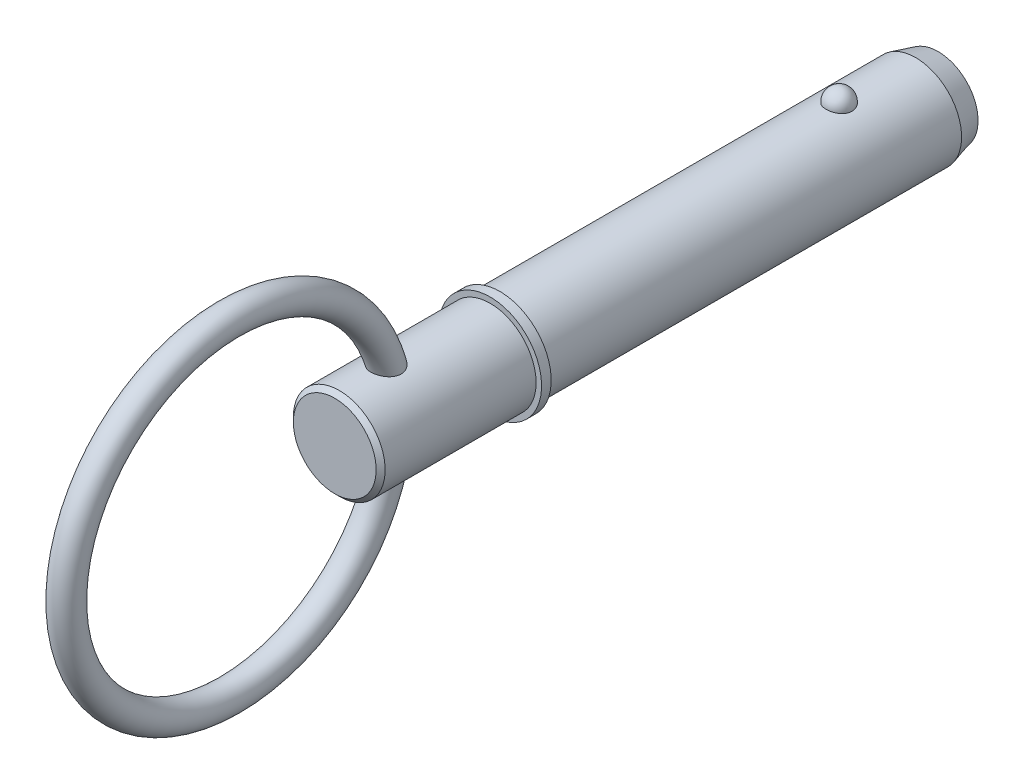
from build123d import *

# Parameters (mm, degrees)
SKETCH2_R           = 7.145
BOSS_EXTRUDE1_DEPTH = 50.8
BOSS_EXTRUDE2_START = 17.45
SKETCH3_R           = 7.145
BOSS_EXTRUDE2_DEPTH = 17.45
CHAMFER1_SIZE       = 3.5
CHAMFER1_SIZE2      = 0.937822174
SKETCH20_W          = 1.5
SKETCH20_H          = 8
SKETCH21_R          = 7.145
BOSS_EXTRUDE3_DEPTH = 25.7
CHAMFER2_SIZE       = 0.7
SKETCH24_R          = 2.25


with BuildPart() as part:
    # Sketch2 → Boss-Extrude1 (new body)
    with BuildSketch(Plane.XY):
        Circle(SKETCH2_R)
    extrude(amount=BOSS_EXTRUDE1_DEPTH)

    # Sketch3 → Boss-Extrude2 (add)
    with BuildSketch(Plane(origin=(0, 0, 0), x_dir=(-1, 0, 0), z_dir=(0, 0, -1)).offset(BOSS_EXTRUDE2_START)):
        Circle(SKETCH3_R)
    extrude(amount=-BOSS_EXTRUDE2_DEPTH)

    # Chamfer1
    chamfer1_edges = [part.edges().sort_by_distance(p)[0] for p in [
        (7.145, 0, -17.45),
    ]]
    chamfer1_side = [part.faces().sort_by_distance(p)[0] for p in [
        (7.145, 0, -8.725),
    ]]
    chamfer(chamfer1_edges, length=CHAMFER1_SIZE, length2=CHAMFER1_SIZE2, reference=chamfer1_side[0])

    # Sketch18 → Revolve1 (revolve)
    with BuildSketch(Plane(origin=(0, 0, 0), x_dir=(0, 0, -1), z_dir=(1, 0, 0))):
        with BuildLine():
            Line((2.02, 9.165), (2.02, 5.125))
            ThreePointArc((2.02, 5.125), (0, 7.145), (2.02, 9.165))
        make_face()
    revolve(axis=Axis((0, 9.165, -2.02), (0, -1, 0)))

    # Sketch20 → Revolve2 (revolve)
    with BuildSketch(Plane(origin=(0, 0, 0), x_dir=(0, 0, -1), z_dir=(1, 0, 0)), mode=Mode.PRIVATE) as revolve2_sk:
        with Locations((-51.55, 4)):
            Rectangle(SKETCH20_W, SKETCH20_H)
    revolve(revolve2_sk.sketch.rotate(Axis((0, 0, 33.728787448), (0, 0, 1)), 90), axis=Axis((0, 0, 33.728787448), (0, 0, 1)))

    # Sketch21 → Boss-Extrude3 (add)
    with BuildSketch(Plane(origin=(0, 0, 50.8), x_dir=(-1, 0, 0), z_dir=(0, 0, -1))):
        Circle(SKETCH21_R)
    extrude(amount=-BOSS_EXTRUDE3_DEPTH)

    # Chamfer2
    chamfer2_edges = [part.edges().sort_by_distance(p)[0] for p in [
        (7.145, 0, 76.5),
    ]]
    chamfer(chamfer2_edges, length=CHAMFER2_SIZE)

    # Sweep1: sweep along a path in Sketch23
    with BuildLine(Plane(origin=(0, 0, 0), x_dir=(0, 0, -1), z_dir=(1, 0, 0))) as sweep1_path:
        CenterArc((-92.9, 0), 25.4, 0, 360)
    # Sketch24 → Sweep1 (sweep)
    with BuildSketch(Plane(origin=(0, 0, 0), x_dir=(1, 0, 0), z_dir=(0, 1, 0))):
        with Locations((0, -67.5)):
            Circle(SKETCH24_R)
    sweep(path=sweep1_path.line)


solid = part.part
